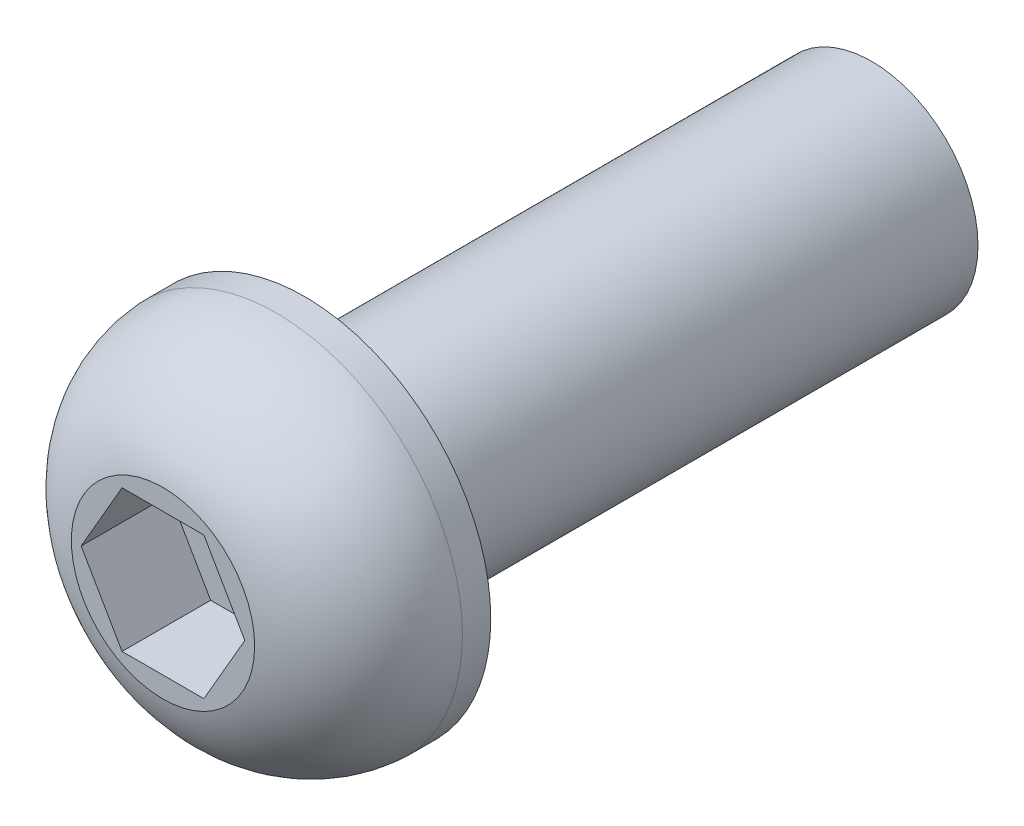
ISO-10303-21;
HEADER;
FILE_DESCRIPTION(('STEP AP214'),'2;1');
FILE_NAME('part.step','',(''),(''),'','','');
FILE_SCHEMA(('AUTOMOTIVE_DESIGN { 1 0 10303 214 1 1 1 1 }'));
ENDSEC;
DATA;
#1=APPLICATION_CONTEXT('core data for automotive mechanical design processes');
#2=APPLICATION_PROTOCOL_DEFINITION('international standard','automotive_design',2000,#1);
#3=PRODUCT_CONTEXT('',#1,'mechanical');
#4=PRODUCT('Part','Part','',(#3));
#5=PRODUCT_RELATED_PRODUCT_CATEGORY('part','',(#4));
#6=PRODUCT_DEFINITION_FORMATION('','',#4);
#7=PRODUCT_DEFINITION_CONTEXT('part definition',#1,'design');
#8=PRODUCT_DEFINITION('design','',#6,#7);
#9=PRODUCT_DEFINITION_SHAPE('','',#8);
#10=(LENGTH_UNIT() NAMED_UNIT(*) SI_UNIT(.MILLI.,.METRE.));
#11=(NAMED_UNIT(*) PLANE_ANGLE_UNIT() SI_UNIT($,.RADIAN.));
#12=(NAMED_UNIT(*) SI_UNIT($,.STERADIAN.) SOLID_ANGLE_UNIT());
#13=UNCERTAINTY_MEASURE_WITH_UNIT(LENGTH_MEASURE(1.E-05),#10,'distance_accuracy_value','');
#14=(GEOMETRIC_REPRESENTATION_CONTEXT(3) GLOBAL_UNCERTAINTY_ASSIGNED_CONTEXT((#13)) GLOBAL_UNIT_ASSIGNED_CONTEXT((#10,
#11,#12)) REPRESENTATION_CONTEXT('',''));
#15=CARTESIAN_POINT('',(0.,0.,0.));
#16=DIRECTION('',(0.,0.,1.));
#17=DIRECTION('',(1.,0.,0.));
#18=AXIS2_PLACEMENT_3D('',#15,#16,#17);
#19=CARTESIAN_POINT('',(0.,0.,-11.));
#20=DIRECTION('',(0.,0.,1.));
#21=DIRECTION('',(1.,0.,0.));
#22=AXIS2_PLACEMENT_3D('',#19,#20,#21);
#23=PLANE('',#22);
#24=CARTESIAN_POINT('',(0.,0.,-11.));
#25=DIRECTION('',(0.,0.,1.));
#26=DIRECTION('',(1.,0.,0.));
#27=AXIS2_PLACEMENT_3D('',#24,#25,#26);
#28=CIRCLE('',#27,3.);
#29=CARTESIAN_POINT('',(3.,0.,-11.));
#30=VERTEX_POINT('',#29);
#31=EDGE_CURVE('E10',#30,#30,#28,.T.);
#32=ORIENTED_EDGE('',*,*,#31,.F.);
#33=EDGE_LOOP('',(#32));
#34=FACE_BOUND('',#33,.T.);
#35=ADVANCED_FACE('F15',(#34),#23,.F.);
#36=CARTESIAN_POINT('',(0.,0.,9.));
#37=DIRECTION('',(0.,0.,1.));
#38=DIRECTION('',(1.,0.,0.));
#39=AXIS2_PLACEMENT_3D('',#36,#37,#38);
#40=CYLINDRICAL_SURFACE('',#39,3.);
#41=ORIENTED_EDGE('',*,*,#31,.T.);
#42=EDGE_LOOP('',(#41));
#43=FACE_BOUND('',#42,.T.);
#44=CARTESIAN_POINT('',(0.,0.,5.));
#45=DIRECTION('',(0.,0.,1.));
#46=DIRECTION('',(1.,0.,0.));
#47=AXIS2_PLACEMENT_3D('',#44,#45,#46);
#48=CIRCLE('',#47,3.);
#49=CARTESIAN_POINT('',(3.,0.,5.));
#50=VERTEX_POINT('',#49);
#51=EDGE_CURVE('E22',#50,#50,#48,.T.);
#52=ORIENTED_EDGE('',*,*,#51,.F.);
#53=EDGE_LOOP('',(#52));
#54=FACE_BOUND('',#53,.T.);
#55=ADVANCED_FACE('F135',(#43,#54),#40,.T.);
#56=CARTESIAN_POINT('',(0.,5.2,5.));
#57=DIRECTION('',(0.,0.,1.));
#58=DIRECTION('',(1.,0.,0.));
#59=AXIS2_PLACEMENT_3D('',#56,#57,#58);
#60=PLANE('',#59);
#61=CARTESIAN_POINT('',(0.,0.,5.));
#62=DIRECTION('',(0.,0.,1.));
#63=DIRECTION('',(1.,0.,0.));
#64=AXIS2_PLACEMENT_3D('',#61,#62,#63);
#65=CIRCLE('',#64,5.25);
#66=CARTESIAN_POINT('',(5.25,0.,5.));
#67=VERTEX_POINT('',#66);
#68=EDGE_CURVE('E128',#67,#67,#65,.T.);
#69=ORIENTED_EDGE('',*,*,#68,.F.);
#70=EDGE_LOOP('',(#69));
#71=FACE_BOUND('',#70,.T.);
#72=ORIENTED_EDGE('',*,*,#51,.T.);
#73=EDGE_LOOP('',(#72));
#74=FACE_BOUND('',#73,.T.);
#75=ADVANCED_FACE('F133',(#71,#74),#60,.F.);
#76=CARTESIAN_POINT('',(0.,0.,9.));
#77=DIRECTION('',(0.,0.,1.));
#78=DIRECTION('',(1.,0.,0.));
#79=AXIS2_PLACEMENT_3D('',#76,#77,#78);
#80=CYLINDRICAL_SURFACE('',#79,5.25);
#81=ORIENTED_EDGE('',*,*,#68,.T.);
#82=EDGE_LOOP('',(#81));
#83=FACE_BOUND('',#82,.T.);
#84=CARTESIAN_POINT('',(0.,0.,5.8));
#85=DIRECTION('',(0.,0.,1.));
#86=DIRECTION('',(1.,0.,0.));
#87=AXIS2_PLACEMENT_3D('',#84,#85,#86);
#88=CIRCLE('',#87,5.25);
#89=CARTESIAN_POINT('',(5.25,0.,5.8));
#90=VERTEX_POINT('',#89);
#91=EDGE_CURVE('E125',#90,#90,#88,.T.);
#92=ORIENTED_EDGE('',*,*,#91,.F.);
#93=EDGE_LOOP('',(#92));
#94=FACE_BOUND('',#93,.T.);
#95=ADVANCED_FACE('F144',(#83,#94),#80,.T.);
#96=CARTESIAN_POINT('',(0.,0.,5.60000000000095));
#97=DIRECTION('',(0.,0.,1.));
#98=DIRECTION('',(1.,0.,0.));
#99=AXIS2_PLACEMENT_3D('',#96,#97,#98);
#100=DEGENERATE_TOROIDAL_SURFACE('',#99,1.75571895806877,3.5,.T.);
#101=CARTESIAN_POINT('',(0.,0.,9.));
#102=DIRECTION('',(0.,0.,1.));
#103=DIRECTION('',(1.,0.,0.));
#104=AXIS2_PLACEMENT_3D('',#101,#102,#103);
#105=CIRCLE('',#104,2.58638134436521);
#106=CARTESIAN_POINT('',(2.58638134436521,0.,9.));
#107=VERTEX_POINT('',#106);
#108=EDGE_CURVE('E122',#107,#107,#105,.T.);
#109=ORIENTED_EDGE('',*,*,#108,.F.);
#110=EDGE_LOOP('',(#109));
#111=FACE_BOUND('',#110,.T.);
#112=ORIENTED_EDGE('',*,*,#91,.T.);
#113=EDGE_LOOP('',(#112));
#114=FACE_BOUND('',#113,.T.);
#115=ADVANCED_FACE('F151',(#111,#114),#100,.T.);
#116=CARTESIAN_POINT('',(0.,0.,9.));
#117=DIRECTION('',(0.,0.,1.));
#118=DIRECTION('',(1.,0.,0.));
#119=AXIS2_PLACEMENT_3D('',#116,#117,#118);
#120=PLANE('',#119);
#121=DIRECTION('',(-0.5,-0.86602540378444,0.));
#122=VECTOR('',#121,1.);
#123=CARTESIAN_POINT('',(-1.15470053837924,2.,9.));
#124=LINE('',#123,#122);
#125=CARTESIAN_POINT('',(-1.15470053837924,2.,9.));
#126=VERTEX_POINT('',#125);
#127=CARTESIAN_POINT('',(-2.30940107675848,0.,9.));
#128=VERTEX_POINT('',#127);
#129=EDGE_CURVE('E29',#126,#128,#124,.T.);
#130=ORIENTED_EDGE('',*,*,#129,.F.);
#131=DIRECTION('',(1.,0.,0.));
#132=VECTOR('',#131,1.);
#133=CARTESIAN_POINT('',(-1.15470053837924,2.,9.));
#134=LINE('',#133,#132);
#135=CARTESIAN_POINT('',(1.15470053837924,2.,9.));
#136=VERTEX_POINT('',#135);
#137=EDGE_CURVE('E98',#126,#136,#134,.T.);
#138=ORIENTED_EDGE('',*,*,#137,.T.);
#139=DIRECTION('',(0.5,-0.86602540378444,0.));
#140=VECTOR('',#139,1.);
#141=CARTESIAN_POINT('',(1.15470053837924,2.,9.));
#142=LINE('',#141,#140);
#143=CARTESIAN_POINT('',(2.30940107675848,0.,9.));
#144=VERTEX_POINT('',#143);
#145=EDGE_CURVE('E93',#136,#144,#142,.T.);
#146=ORIENTED_EDGE('',*,*,#145,.T.);
#147=DIRECTION('',(0.5,0.86602540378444,0.));
#148=VECTOR('',#147,1.);
#149=CARTESIAN_POINT('',(1.15470053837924,-2.,9.));
#150=LINE('',#149,#148);
#151=CARTESIAN_POINT('',(1.15470053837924,-2.,9.));
#152=VERTEX_POINT('',#151);
#153=EDGE_CURVE('E91',#152,#144,#150,.T.);
#154=ORIENTED_EDGE('',*,*,#153,.F.);
#155=DIRECTION('',(1.,0.,0.));
#156=VECTOR('',#155,1.);
#157=CARTESIAN_POINT('',(-1.15470053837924,-2.,9.));
#158=LINE('',#157,#156);
#159=CARTESIAN_POINT('',(-1.15470053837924,-2.,9.));
#160=VERTEX_POINT('',#159);
#161=EDGE_CURVE('E72',#160,#152,#158,.T.);
#162=ORIENTED_EDGE('',*,*,#161,.F.);
#163=DIRECTION('',(-0.5,0.86602540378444,0.));
#164=VECTOR('',#163,1.);
#165=CARTESIAN_POINT('',(-1.15470053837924,-2.,9.));
#166=LINE('',#165,#164);
#167=EDGE_CURVE('E83',#160,#128,#166,.T.);
#168=ORIENTED_EDGE('',*,*,#167,.T.);
#169=EDGE_LOOP('',(#130,#138,#146,#154,#162,#168));
#170=FACE_BOUND('',#169,.T.);
#171=ORIENTED_EDGE('',*,*,#108,.T.);
#172=EDGE_LOOP('',(#171));
#173=FACE_BOUND('',#172,.T.);
#174=ADVANCED_FACE('F87',(#170,#173),#120,.T.);
#175=CARTESIAN_POINT('',(-1.15470053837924,2.,6.5));
#176=DIRECTION('',(-0.86602540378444,0.5,0.));
#177=DIRECTION('',(-0.5,-0.86602540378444,0.));
#178=AXIS2_PLACEMENT_3D('',#175,#176,#177);
#179=PLANE('',#178);
#180=DIRECTION('',(0.,0.,1.));
#181=VECTOR('',#180,1.);
#182=CARTESIAN_POINT('',(-1.15470053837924,2.,6.5));
#183=LINE('',#182,#181);
#184=CARTESIAN_POINT('',(-1.15470053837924,2.,6.5));
#185=VERTEX_POINT('',#184);
#186=EDGE_CURVE('E36',#185,#126,#183,.T.);
#187=ORIENTED_EDGE('',*,*,#186,.T.);
#188=ORIENTED_EDGE('',*,*,#129,.T.);
#189=DIRECTION('',(0.,0.,1.));
#190=VECTOR('',#189,1.);
#191=CARTESIAN_POINT('',(-2.30940107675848,0.,6.5));
#192=LINE('',#191,#190);
#193=CARTESIAN_POINT('',(-2.30940107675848,0.,6.5));
#194=VERTEX_POINT('',#193);
#195=EDGE_CURVE('E80',#194,#128,#192,.T.);
#196=ORIENTED_EDGE('',*,*,#195,.F.);
#197=DIRECTION('',(-0.5,-0.86602540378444,0.));
#198=VECTOR('',#197,1.);
#199=CARTESIAN_POINT('',(-1.15470053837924,2.,6.5));
#200=LINE('',#199,#198);
#201=EDGE_CURVE('E101',#185,#194,#200,.T.);
#202=ORIENTED_EDGE('',*,*,#201,.F.);
#203=EDGE_LOOP('',(#187,#188,#196,#202));
#204=FACE_BOUND('',#203,.T.);
#205=ADVANCED_FACE('F158',(#204),#179,.F.);
#206=CARTESIAN_POINT('',(-1.15470053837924,2.,6.5));
#207=DIRECTION('',(0.,-1.,0.));
#208=DIRECTION('',(1.,0.,0.));
#209=AXIS2_PLACEMENT_3D('',#206,#207,#208);
#210=PLANE('',#209);
#211=DIRECTION('',(0.,0.,1.));
#212=VECTOR('',#211,1.);
#213=CARTESIAN_POINT('',(1.15470053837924,2.,6.5));
#214=LINE('',#213,#212);
#215=CARTESIAN_POINT('',(1.15470053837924,2.,6.5));
#216=VERTEX_POINT('',#215);
#217=EDGE_CURVE('E119',#216,#136,#214,.T.);
#218=ORIENTED_EDGE('',*,*,#217,.T.);
#219=ORIENTED_EDGE('',*,*,#137,.F.);
#220=ORIENTED_EDGE('',*,*,#186,.F.);
#221=DIRECTION('',(1.,0.,0.));
#222=VECTOR('',#221,1.);
#223=CARTESIAN_POINT('',(-1.15470053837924,2.,6.5));
#224=LINE('',#223,#222);
#225=EDGE_CURVE('E113',#185,#216,#224,.T.);
#226=ORIENTED_EDGE('',*,*,#225,.T.);
#227=EDGE_LOOP('',(#218,#219,#220,#226));
#228=FACE_BOUND('',#227,.T.);
#229=ADVANCED_FACE('F159',(#228),#210,.T.);
#230=CARTESIAN_POINT('',(1.15470053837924,2.,6.5));
#231=DIRECTION('',(-0.86602540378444,-0.5,0.));
#232=DIRECTION('',(0.5,-0.86602540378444,0.));
#233=AXIS2_PLACEMENT_3D('',#230,#231,#232);
#234=PLANE('',#233);
#235=DIRECTION('',(0.,0.,1.));
#236=VECTOR('',#235,1.);
#237=CARTESIAN_POINT('',(2.30940107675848,0.,6.5));
#238=LINE('',#237,#236);
#239=CARTESIAN_POINT('',(2.30940107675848,0.,6.5));
#240=VERTEX_POINT('',#239);
#241=EDGE_CURVE('E117',#240,#144,#238,.T.);
#242=ORIENTED_EDGE('',*,*,#241,.T.);
#243=ORIENTED_EDGE('',*,*,#145,.F.);
#244=ORIENTED_EDGE('',*,*,#217,.F.);
#245=DIRECTION('',(0.5,-0.86602540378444,0.));
#246=VECTOR('',#245,1.);
#247=CARTESIAN_POINT('',(1.15470053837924,2.,6.5));
#248=LINE('',#247,#246);
#249=EDGE_CURVE('E110',#216,#240,#248,.T.);
#250=ORIENTED_EDGE('',*,*,#249,.T.);
#251=EDGE_LOOP('',(#242,#243,#244,#250));
#252=FACE_BOUND('',#251,.T.);
#253=ADVANCED_FACE('F162',(#252),#234,.T.);
#254=CARTESIAN_POINT('',(1.15470053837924,-2.,6.5));
#255=DIRECTION('',(0.86602540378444,-0.5,0.));
#256=DIRECTION('',(0.5,0.86602540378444,0.));
#257=AXIS2_PLACEMENT_3D('',#254,#255,#256);
#258=PLANE('',#257);
#259=DIRECTION('',(0.,0.,1.));
#260=VECTOR('',#259,1.);
#261=CARTESIAN_POINT('',(1.15470053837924,-2.,6.5));
#262=LINE('',#261,#260);
#263=CARTESIAN_POINT('',(1.15470053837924,-2.,6.5));
#264=VERTEX_POINT('',#263);
#265=EDGE_CURVE('E79',#264,#152,#262,.T.);
#266=ORIENTED_EDGE('',*,*,#265,.T.);
#267=ORIENTED_EDGE('',*,*,#153,.T.);
#268=ORIENTED_EDGE('',*,*,#241,.F.);
#269=DIRECTION('',(0.5,0.86602540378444,0.));
#270=VECTOR('',#269,1.);
#271=CARTESIAN_POINT('',(1.15470053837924,-2.,6.5));
#272=LINE('',#271,#270);
#273=EDGE_CURVE('E107',#264,#240,#272,.T.);
#274=ORIENTED_EDGE('',*,*,#273,.F.);
#275=EDGE_LOOP('',(#266,#267,#268,#274));
#276=FACE_BOUND('',#275,.T.);
#277=ADVANCED_FACE('F165',(#276),#258,.F.);
#278=CARTESIAN_POINT('',(-1.15470053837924,-2.,6.5));
#279=DIRECTION('',(0.,-1.,0.));
#280=DIRECTION('',(1.,0.,0.));
#281=AXIS2_PLACEMENT_3D('',#278,#279,#280);
#282=PLANE('',#281);
#283=DIRECTION('',(0.,0.,1.));
#284=VECTOR('',#283,1.);
#285=CARTESIAN_POINT('',(-1.15470053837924,-2.,6.5));
#286=LINE('',#285,#284);
#287=CARTESIAN_POINT('',(-1.15470053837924,-2.,6.5));
#288=VERTEX_POINT('',#287);
#289=EDGE_CURVE('E68',#288,#160,#286,.T.);
#290=ORIENTED_EDGE('',*,*,#289,.T.);
#291=ORIENTED_EDGE('',*,*,#161,.T.);
#292=ORIENTED_EDGE('',*,*,#265,.F.);
#293=DIRECTION('',(1.,0.,0.));
#294=VECTOR('',#293,1.);
#295=CARTESIAN_POINT('',(-1.15470053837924,-2.,6.5));
#296=LINE('',#295,#294);
#297=EDGE_CURVE('E75',#288,#264,#296,.T.);
#298=ORIENTED_EDGE('',*,*,#297,.F.);
#299=EDGE_LOOP('',(#290,#291,#292,#298));
#300=FACE_BOUND('',#299,.T.);
#301=ADVANCED_FACE('F70',(#300),#282,.F.);
#302=CARTESIAN_POINT('',(-1.15470053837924,-2.,6.5));
#303=DIRECTION('',(0.86602540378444,0.5,0.));
#304=DIRECTION('',(-0.5,0.86602540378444,0.));
#305=AXIS2_PLACEMENT_3D('',#302,#303,#304);
#306=PLANE('',#305);
#307=DIRECTION('',(-0.5,0.86602540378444,0.));
#308=VECTOR('',#307,1.);
#309=CARTESIAN_POINT('',(-1.15470053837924,-2.,6.5));
#310=LINE('',#309,#308);
#311=EDGE_CURVE('E104',#288,#194,#310,.T.);
#312=ORIENTED_EDGE('',*,*,#311,.T.);
#313=ORIENTED_EDGE('',*,*,#195,.T.);
#314=ORIENTED_EDGE('',*,*,#167,.F.);
#315=ORIENTED_EDGE('',*,*,#289,.F.);
#316=EDGE_LOOP('',(#312,#313,#314,#315));
#317=FACE_BOUND('',#316,.T.);
#318=ADVANCED_FACE('F84',(#317),#306,.T.);
#319=CARTESIAN_POINT('',(-3.46410161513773,-2.,6.5));
#320=DIRECTION('',(0.,0.,1.));
#321=DIRECTION('',(1.,0.,0.));
#322=AXIS2_PLACEMENT_3D('',#319,#320,#321);
#323=PLANE('',#322);
#324=ORIENTED_EDGE('',*,*,#201,.T.);
#325=ORIENTED_EDGE('',*,*,#311,.F.);
#326=ORIENTED_EDGE('',*,*,#297,.T.);
#327=ORIENTED_EDGE('',*,*,#273,.T.);
#328=ORIENTED_EDGE('',*,*,#249,.F.);
#329=ORIENTED_EDGE('',*,*,#225,.F.);
#330=EDGE_LOOP('',(#324,#325,#326,#327,#328,#329));
#331=FACE_BOUND('',#330,.T.);
#332=ADVANCED_FACE('F172',(#331),#323,.T.);
#333=CLOSED_SHELL('',(#35,#55,#75,#95,#115,#174,#205,#229,#253,#277,#301,#318,#332));
#334=MANIFOLD_SOLID_BREP('B1',#333);
#335=ADVANCED_BREP_SHAPE_REPRESENTATION('',(#18,#334),#14);
#336=SHAPE_DEFINITION_REPRESENTATION(#9,#335);
ENDSEC;
END-ISO-10303-21;
